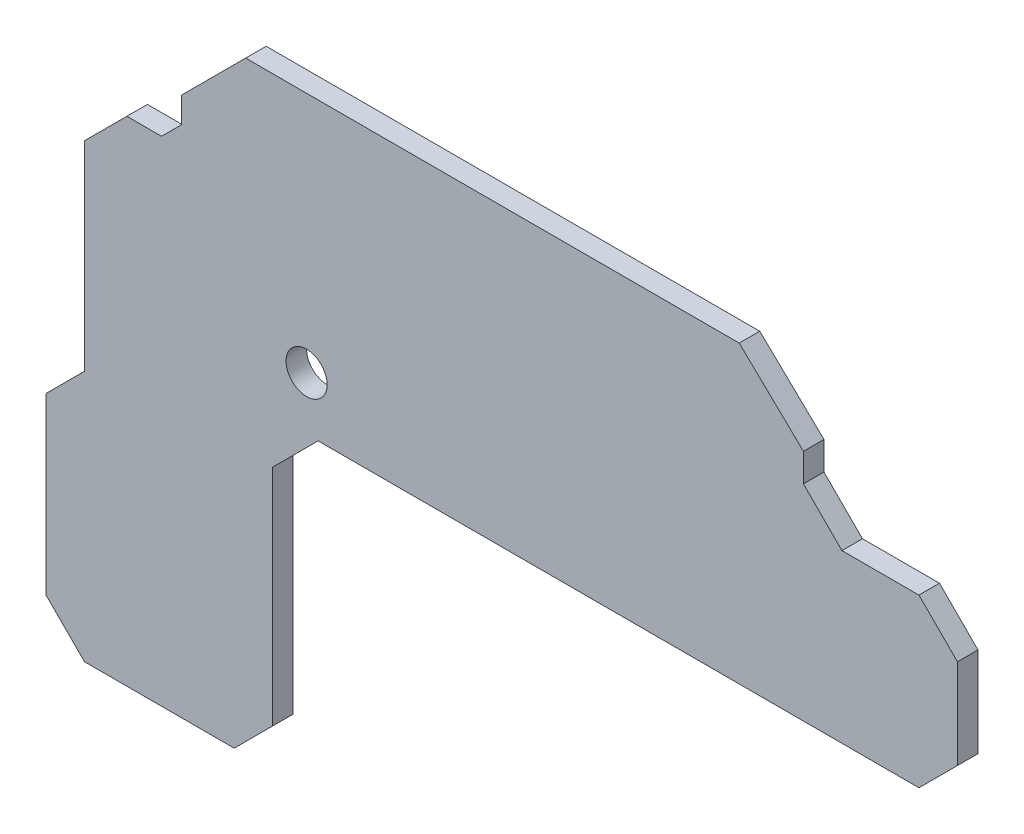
ISO-10303-21;
HEADER;
FILE_DESCRIPTION(('STEP AP214'),'2;1');
FILE_NAME('part.step','',(''),(''),'','','');
FILE_SCHEMA(('AUTOMOTIVE_DESIGN { 1 0 10303 214 1 1 1 1 }'));
ENDSEC;
DATA;
#1=APPLICATION_CONTEXT('core data for automotive mechanical design processes');
#2=APPLICATION_PROTOCOL_DEFINITION('international standard','automotive_design',2000,#1);
#3=PRODUCT_CONTEXT('',#1,'mechanical');
#4=PRODUCT('Part','Part','',(#3));
#5=PRODUCT_RELATED_PRODUCT_CATEGORY('part','',(#4));
#6=PRODUCT_DEFINITION_FORMATION('','',#4);
#7=PRODUCT_DEFINITION_CONTEXT('part definition',#1,'design');
#8=PRODUCT_DEFINITION('design','',#6,#7);
#9=PRODUCT_DEFINITION_SHAPE('','',#8);
#10=(LENGTH_UNIT() NAMED_UNIT(*) SI_UNIT(.MILLI.,.METRE.));
#11=(NAMED_UNIT(*) PLANE_ANGLE_UNIT() SI_UNIT($,.RADIAN.));
#12=(NAMED_UNIT(*) SI_UNIT($,.STERADIAN.) SOLID_ANGLE_UNIT());
#13=UNCERTAINTY_MEASURE_WITH_UNIT(LENGTH_MEASURE(1.E-05),#10,'distance_accuracy_value','');
#14=(GEOMETRIC_REPRESENTATION_CONTEXT(3) GLOBAL_UNCERTAINTY_ASSIGNED_CONTEXT((#13)) GLOBAL_UNIT_ASSIGNED_CONTEXT((#10,
#11,#12)) REPRESENTATION_CONTEXT('',''));
#15=CARTESIAN_POINT('',(0.,0.,0.));
#16=DIRECTION('',(0.,0.,1.));
#17=DIRECTION('',(1.,0.,0.));
#18=AXIS2_PLACEMENT_3D('',#15,#16,#17);
#19=CARTESIAN_POINT('',(0.,0.,0.));
#20=DIRECTION('',(0.,0.,1.));
#21=DIRECTION('',(1.,0.,0.));
#22=AXIS2_PLACEMENT_3D('',#19,#20,#21);
#23=PLANE('',#22);
#24=DIRECTION('',(0.707106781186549,0.707106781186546,0.));
#25=VECTOR('',#24,1.);
#26=CARTESIAN_POINT('',(-41.33,-15.9,0.));
#27=LINE('',#26,#25);
#28=CARTESIAN_POINT('',(-44.33,-18.9,0.));
#29=VERTEX_POINT('',#28);
#30=CARTESIAN_POINT('',(-41.33,-15.9,0.));
#31=VERTEX_POINT('',#30);
#32=EDGE_CURVE('E193',#29,#31,#27,.T.);
#33=ORIENTED_EDGE('',*,*,#32,.T.);
#34=DIRECTION('',(0.,1.,0.));
#35=VECTOR('',#34,1.);
#36=CARTESIAN_POINT('',(-41.33,-0.350000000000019,0.));
#37=LINE('',#36,#35);
#38=CARTESIAN_POINT('',(-41.33,-0.350000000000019,0.));
#39=VERTEX_POINT('',#38);
#40=EDGE_CURVE('E203',#31,#39,#37,.T.);
#41=ORIENTED_EDGE('',*,*,#40,.T.);
#42=DIRECTION('',(0.707106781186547,0.707106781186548,0.));
#43=VECTOR('',#42,1.);
#44=CARTESIAN_POINT('',(-38.03,2.94999999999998,0.));
#45=LINE('',#44,#43);
#46=CARTESIAN_POINT('',(-38.03,2.94999999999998,0.));
#47=VERTEX_POINT('',#46);
#48=EDGE_CURVE('E207',#39,#47,#45,.T.);
#49=ORIENTED_EDGE('',*,*,#48,.T.);
#50=DIRECTION('',(1.,0.,0.));
#51=VECTOR('',#50,1.);
#52=CARTESIAN_POINT('',(-35.33,2.94999999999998,0.));
#53=LINE('',#52,#51);
#54=CARTESIAN_POINT('',(-35.33,2.94999999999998,0.));
#55=VERTEX_POINT('',#54);
#56=EDGE_CURVE('E212',#47,#55,#53,.T.);
#57=ORIENTED_EDGE('',*,*,#56,.T.);
#58=DIRECTION('',(0.707106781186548,0.707106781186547,0.));
#59=VECTOR('',#58,1.);
#60=CARTESIAN_POINT('',(-33.78,4.49999999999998,0.));
#61=LINE('',#60,#59);
#62=CARTESIAN_POINT('',(-33.78,4.49999999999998,0.));
#63=VERTEX_POINT('',#62);
#64=EDGE_CURVE('E217',#55,#63,#61,.T.);
#65=ORIENTED_EDGE('',*,*,#64,.T.);
#66=DIRECTION('',(0.,1.,0.));
#67=VECTOR('',#66,1.);
#68=CARTESIAN_POINT('',(-33.78,6.49999999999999,0.));
#69=LINE('',#68,#67);
#70=CARTESIAN_POINT('',(-33.78,6.49999999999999,0.));
#71=VERTEX_POINT('',#70);
#72=EDGE_CURVE('E222',#63,#71,#69,.T.);
#73=ORIENTED_EDGE('',*,*,#72,.T.);
#74=DIRECTION('',(0.707106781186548,0.707106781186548,0.));
#75=VECTOR('',#74,1.);
#76=CARTESIAN_POINT('',(-28.78,11.5,0.));
#77=LINE('',#76,#75);
#78=CARTESIAN_POINT('',(-28.78,11.5,0.));
#79=VERTEX_POINT('',#78);
#80=EDGE_CURVE('E227',#71,#79,#77,.T.);
#81=ORIENTED_EDGE('',*,*,#80,.T.);
#82=DIRECTION('',(1.,0.,0.));
#83=VECTOR('',#82,1.);
#84=CARTESIAN_POINT('',(9.66999999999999,11.5,0.));
#85=LINE('',#84,#83);
#86=CARTESIAN_POINT('',(9.66999999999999,11.5,0.));
#87=VERTEX_POINT('',#86);
#88=EDGE_CURVE('E232',#79,#87,#85,.T.);
#89=ORIENTED_EDGE('',*,*,#88,.T.);
#90=DIRECTION('',(0.721387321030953,-0.692531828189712,0.));
#91=VECTOR('',#90,1.);
#92=CARTESIAN_POINT('',(14.67,6.70000000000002,0.));
#93=LINE('',#92,#91);
#94=CARTESIAN_POINT('',(14.67,6.70000000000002,0.));
#95=VERTEX_POINT('',#94);
#96=EDGE_CURVE('E237',#87,#95,#93,.T.);
#97=ORIENTED_EDGE('',*,*,#96,.T.);
#98=DIRECTION('',(0.,-1.,0.));
#99=VECTOR('',#98,1.);
#100=CARTESIAN_POINT('',(14.67,4.50000000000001,0.));
#101=LINE('',#100,#99);
#102=CARTESIAN_POINT('',(14.67,4.50000000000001,0.));
#103=VERTEX_POINT('',#102);
#104=EDGE_CURVE('E242',#95,#103,#101,.T.);
#105=ORIENTED_EDGE('',*,*,#104,.T.);
#106=DIRECTION('',(0.707106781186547,-0.707106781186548,0.));
#107=VECTOR('',#106,1.);
#108=CARTESIAN_POINT('',(17.67,1.50000000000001,0.));
#109=LINE('',#108,#107);
#110=CARTESIAN_POINT('',(17.67,1.50000000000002,0.));
#111=VERTEX_POINT('',#110);
#112=EDGE_CURVE('E247',#103,#111,#109,.T.);
#113=ORIENTED_EDGE('',*,*,#112,.T.);
#114=DIRECTION('',(1.,0.,0.));
#115=VECTOR('',#114,1.);
#116=CARTESIAN_POINT('',(23.67,1.50000000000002,0.));
#117=LINE('',#116,#115);
#118=CARTESIAN_POINT('',(23.67,1.50000000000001,0.));
#119=VERTEX_POINT('',#118);
#120=EDGE_CURVE('E252',#111,#119,#117,.T.);
#121=ORIENTED_EDGE('',*,*,#120,.T.);
#122=DIRECTION('',(0.707106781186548,-0.707106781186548,0.));
#123=VECTOR('',#122,1.);
#124=CARTESIAN_POINT('',(26.67,-1.49999999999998,0.));
#125=LINE('',#124,#123);
#126=CARTESIAN_POINT('',(26.67,-1.49999999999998,0.));
#127=VERTEX_POINT('',#126);
#128=EDGE_CURVE('E257',#119,#127,#125,.T.);
#129=ORIENTED_EDGE('',*,*,#128,.T.);
#130=DIRECTION('',(0.,1.,0.));
#131=VECTOR('',#130,1.);
#132=CARTESIAN_POINT('',(26.67,-8.49999999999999,0.));
#133=LINE('',#132,#131);
#134=CARTESIAN_POINT('',(26.67,-8.49999999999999,0.));
#135=VERTEX_POINT('',#134);
#136=EDGE_CURVE('E262',#127,#135,#133,.F.);
#137=ORIENTED_EDGE('',*,*,#136,.T.);
#138=DIRECTION('',(-0.707106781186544,-0.707106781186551,0.));
#139=VECTOR('',#138,1.);
#140=CARTESIAN_POINT('',(23.67,-11.5,0.));
#141=LINE('',#140,#139);
#142=CARTESIAN_POINT('',(23.67,-11.5,0.));
#143=VERTEX_POINT('',#142);
#144=EDGE_CURVE('E267',#135,#143,#141,.T.);
#145=ORIENTED_EDGE('',*,*,#144,.T.);
#146=DIRECTION('',(-1.,0.,0.));
#147=VECTOR('',#146,1.);
#148=CARTESIAN_POINT('',(-23.1339322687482,-11.5,0.));
#149=LINE('',#148,#147);
#150=CARTESIAN_POINT('',(-23.1339322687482,-11.5,0.));
#151=VERTEX_POINT('',#150);
#152=EDGE_CURVE('E272',#143,#151,#149,.T.);
#153=ORIENTED_EDGE('',*,*,#152,.T.);
#154=DIRECTION('',(-0.707213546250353,-0.707,0.));
#155=VECTOR('',#154,1.);
#156=CARTESIAN_POINT('',(-26.67,-15.035,0.));
#157=LINE('',#156,#155);
#158=CARTESIAN_POINT('',(-26.67,-15.035,0.));
#159=VERTEX_POINT('',#158);
#160=EDGE_CURVE('E277',#151,#159,#157,.T.);
#161=ORIENTED_EDGE('',*,*,#160,.T.);
#162=DIRECTION('',(0.,-1.,0.));
#163=VECTOR('',#162,1.);
#164=CARTESIAN_POINT('',(-26.67,-32.5,0.));
#165=LINE('',#164,#163);
#166=CARTESIAN_POINT('',(-26.67,-32.5,0.));
#167=VERTEX_POINT('',#166);
#168=EDGE_CURVE('E282',#159,#167,#165,.T.);
#169=ORIENTED_EDGE('',*,*,#168,.T.);
#170=DIRECTION('',(-0.707106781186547,-0.707106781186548,0.));
#171=VECTOR('',#170,1.);
#172=CARTESIAN_POINT('',(-29.67,-35.5,0.));
#173=LINE('',#172,#171);
#174=CARTESIAN_POINT('',(-29.67,-35.5,0.));
#175=VERTEX_POINT('',#174);
#176=EDGE_CURVE('E287',#167,#175,#173,.T.);
#177=ORIENTED_EDGE('',*,*,#176,.T.);
#178=DIRECTION('',(1.,0.,0.));
#179=VECTOR('',#178,1.);
#180=CARTESIAN_POINT('',(-41.33,-35.5,0.));
#181=LINE('',#180,#179);
#182=CARTESIAN_POINT('',(-41.33,-35.5,0.));
#183=VERTEX_POINT('',#182);
#184=EDGE_CURVE('E180',#175,#183,#181,.F.);
#185=ORIENTED_EDGE('',*,*,#184,.T.);
#186=DIRECTION('',(-0.707106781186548,0.707106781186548,0.));
#187=VECTOR('',#186,1.);
#188=CARTESIAN_POINT('',(-44.33,-32.5,0.));
#189=LINE('',#188,#187);
#190=CARTESIAN_POINT('',(-44.33,-32.5,0.));
#191=VERTEX_POINT('',#190);
#192=EDGE_CURVE('E163',#183,#191,#189,.T.);
#193=ORIENTED_EDGE('',*,*,#192,.T.);
#194=DIRECTION('',(0.,1.,0.));
#195=VECTOR('',#194,1.);
#196=CARTESIAN_POINT('',(-44.33,-18.9,0.));
#197=LINE('',#196,#195);
#198=EDGE_CURVE('E168',#191,#29,#197,.T.);
#199=ORIENTED_EDGE('',*,*,#198,.T.);
#200=EDGE_LOOP('',(#33,#41,#49,#57,#65,#73,#81,#89,#97,#105,#113,#121,#129,#137,#145,#153,#161,
#169,#177,#185,#193,#199));
#201=FACE_BOUND('',#200,.T.);
#202=CARTESIAN_POINT('',(-24.03,-7.36,0.));
#203=DIRECTION('',(0.,0.,1.));
#204=DIRECTION('',(1.,0.,0.));
#205=AXIS2_PLACEMENT_3D('',#202,#203,#204);
#206=CIRCLE('',#205,1.6);
#207=CARTESIAN_POINT('',(-22.43,-7.36,0.));
#208=VERTEX_POINT('',#207);
#209=EDGE_CURVE('E20',#208,#208,#206,.T.);
#210=ORIENTED_EDGE('',*,*,#209,.T.);
#211=EDGE_LOOP('',(#210));
#212=FACE_BOUND('',#211,.T.);
#213=ADVANCED_FACE('F17',(#201,#212),#23,.F.);
#214=CARTESIAN_POINT('',(-24.03,-7.36,0.));
#215=DIRECTION('',(0.,0.,1.));
#216=DIRECTION('',(1.,0.,0.));
#217=AXIS2_PLACEMENT_3D('',#214,#215,#216);
#218=CYLINDRICAL_SURFACE('',#217,1.6);
#219=CARTESIAN_POINT('',(-24.03,-7.36,1.6));
#220=DIRECTION('',(0.,0.,1.));
#221=DIRECTION('',(1.,0.,0.));
#222=AXIS2_PLACEMENT_3D('',#219,#220,#221);
#223=CIRCLE('',#222,1.6);
#224=CARTESIAN_POINT('',(-22.43,-7.36,1.6));
#225=VERTEX_POINT('',#224);
#226=EDGE_CURVE('E190',#225,#225,#223,.F.);
#227=ORIENTED_EDGE('',*,*,#226,.F.);
#228=EDGE_LOOP('',(#227));
#229=FACE_BOUND('',#228,.T.);
#230=ORIENTED_EDGE('',*,*,#209,.F.);
#231=EDGE_LOOP('',(#230));
#232=FACE_BOUND('',#231,.T.);
#233=ADVANCED_FACE('F612',(#229,#232),#218,.F.);
#234=CARTESIAN_POINT('',(-44.33,-18.9,1.6));
#235=DIRECTION('',(1.,0.,0.));
#236=DIRECTION('',(0.,0.,-1.));
#237=AXIS2_PLACEMENT_3D('',#234,#235,#236);
#238=PLANE('',#237);
#239=DIRECTION('',(0.,0.,1.));
#240=VECTOR('',#239,1.);
#241=CARTESIAN_POINT('',(-44.33,-32.5,1.6));
#242=LINE('',#241,#240);
#243=CARTESIAN_POINT('',(-44.33,-32.5,1.6));
#244=VERTEX_POINT('',#243);
#245=EDGE_CURVE('E170',#191,#244,#242,.T.);
#246=ORIENTED_EDGE('',*,*,#245,.T.);
#247=DIRECTION('',(0.,1.,0.));
#248=VECTOR('',#247,1.);
#249=CARTESIAN_POINT('',(-44.33,0.,1.6));
#250=LINE('',#249,#248);
#251=CARTESIAN_POINT('',(-44.33,-18.9,1.6));
#252=VERTEX_POINT('',#251);
#253=EDGE_CURVE('E192',#252,#244,#250,.F.);
#254=ORIENTED_EDGE('',*,*,#253,.F.);
#255=DIRECTION('',(0.,0.,1.));
#256=VECTOR('',#255,1.);
#257=CARTESIAN_POINT('',(-44.33,-18.9,1.6));
#258=LINE('',#257,#256);
#259=EDGE_CURVE('E173',#252,#29,#258,.F.);
#260=ORIENTED_EDGE('',*,*,#259,.T.);
#261=ORIENTED_EDGE('',*,*,#198,.F.);
#262=EDGE_LOOP('',(#246,#254,#260,#261));
#263=FACE_BOUND('',#262,.T.);
#264=ADVANCED_FACE('F169',(#263),#238,.F.);
#265=CARTESIAN_POINT('',(-44.33,-32.5,1.6));
#266=DIRECTION('',(0.707106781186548,0.707106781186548,0.));
#267=DIRECTION('',(-0.707106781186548,0.707106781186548,0.));
#268=AXIS2_PLACEMENT_3D('',#265,#266,#267);
#269=PLANE('',#268);
#270=DIRECTION('',(0.,0.,1.));
#271=VECTOR('',#270,1.);
#272=CARTESIAN_POINT('',(-41.33,-35.5,1.6));
#273=LINE('',#272,#271);
#274=CARTESIAN_POINT('',(-41.33,-35.5,1.6));
#275=VERTEX_POINT('',#274);
#276=EDGE_CURVE('E182',#183,#275,#273,.T.);
#277=ORIENTED_EDGE('',*,*,#276,.T.);
#278=DIRECTION('',(0.707106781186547,-0.707106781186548,0.));
#279=VECTOR('',#278,1.);
#280=CARTESIAN_POINT('',(-44.33,-32.5,1.6));
#281=LINE('',#280,#279);
#282=EDGE_CURVE('E186',#244,#275,#281,.T.);
#283=ORIENTED_EDGE('',*,*,#282,.F.);
#284=ORIENTED_EDGE('',*,*,#245,.F.);
#285=ORIENTED_EDGE('',*,*,#192,.F.);
#286=EDGE_LOOP('',(#277,#283,#284,#285));
#287=FACE_BOUND('',#286,.T.);
#288=ADVANCED_FACE('F184',(#287),#269,.F.);
#289=CARTESIAN_POINT('',(-41.33,-35.5,1.6));
#290=DIRECTION('',(0.,1.,0.));
#291=DIRECTION('',(0.,0.,1.));
#292=AXIS2_PLACEMENT_3D('',#289,#290,#291);
#293=PLANE('',#292);
#294=DIRECTION('',(0.,0.,1.));
#295=VECTOR('',#294,1.);
#296=CARTESIAN_POINT('',(-29.67,-35.5,1.6));
#297=LINE('',#296,#295);
#298=CARTESIAN_POINT('',(-29.67,-35.5,1.6));
#299=VERTEX_POINT('',#298);
#300=EDGE_CURVE('E289',#175,#299,#297,.T.);
#301=ORIENTED_EDGE('',*,*,#300,.T.);
#302=DIRECTION('',(1.,0.,0.));
#303=VECTOR('',#302,1.);
#304=CARTESIAN_POINT('',(0.,-35.5,1.6));
#305=LINE('',#304,#303);
#306=EDGE_CURVE('E294',#275,#299,#305,.T.);
#307=ORIENTED_EDGE('',*,*,#306,.F.);
#308=ORIENTED_EDGE('',*,*,#276,.F.);
#309=ORIENTED_EDGE('',*,*,#184,.F.);
#310=EDGE_LOOP('',(#301,#307,#308,#309));
#311=FACE_BOUND('',#310,.T.);
#312=ADVANCED_FACE('F295',(#311),#293,.F.);
#313=CARTESIAN_POINT('',(-29.67,-35.5,1.6));
#314=DIRECTION('',(-0.707106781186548,0.707106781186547,0.));
#315=DIRECTION('',(-0.707106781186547,-0.707106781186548,0.));
#316=AXIS2_PLACEMENT_3D('',#313,#314,#315);
#317=PLANE('',#316);
#318=DIRECTION('',(0.,0.,1.));
#319=VECTOR('',#318,1.);
#320=CARTESIAN_POINT('',(-26.67,-32.5,1.6));
#321=LINE('',#320,#319);
#322=CARTESIAN_POINT('',(-26.67,-32.5,1.6));
#323=VERTEX_POINT('',#322);
#324=EDGE_CURVE('E285',#167,#323,#321,.T.);
#325=ORIENTED_EDGE('',*,*,#324,.T.);
#326=DIRECTION('',(0.707106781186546,0.707106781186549,0.));
#327=VECTOR('',#326,1.);
#328=CARTESIAN_POINT('',(-29.67,-35.5,1.6));
#329=LINE('',#328,#327);
#330=EDGE_CURVE('E300',#299,#323,#329,.T.);
#331=ORIENTED_EDGE('',*,*,#330,.F.);
#332=ORIENTED_EDGE('',*,*,#300,.F.);
#333=ORIENTED_EDGE('',*,*,#176,.F.);
#334=EDGE_LOOP('',(#325,#331,#332,#333));
#335=FACE_BOUND('',#334,.T.);
#336=ADVANCED_FACE('F421',(#335),#317,.F.);
#337=CARTESIAN_POINT('',(-26.67,-32.5,1.6));
#338=DIRECTION('',(-1.,0.,0.));
#339=DIRECTION('',(0.,-1.,0.));
#340=AXIS2_PLACEMENT_3D('',#337,#338,#339);
#341=PLANE('',#340);
#342=DIRECTION('',(0.,0.,1.));
#343=VECTOR('',#342,1.);
#344=CARTESIAN_POINT('',(-26.67,-15.035,1.6));
#345=LINE('',#344,#343);
#346=CARTESIAN_POINT('',(-26.67,-15.035,1.6));
#347=VERTEX_POINT('',#346);
#348=EDGE_CURVE('E280',#159,#347,#345,.T.);
#349=ORIENTED_EDGE('',*,*,#348,.T.);
#350=DIRECTION('',(0.,1.,0.));
#351=VECTOR('',#350,1.);
#352=CARTESIAN_POINT('',(-26.67,0.,1.6));
#353=LINE('',#352,#351);
#354=EDGE_CURVE('E306',#323,#347,#353,.T.);
#355=ORIENTED_EDGE('',*,*,#354,.F.);
#356=ORIENTED_EDGE('',*,*,#324,.F.);
#357=ORIENTED_EDGE('',*,*,#168,.F.);
#358=EDGE_LOOP('',(#349,#355,#356,#357));
#359=FACE_BOUND('',#358,.T.);
#360=ADVANCED_FACE('F418',(#359),#341,.F.);
#361=CARTESIAN_POINT('',(-26.67,-15.035,1.6));
#362=DIRECTION('',(-0.707,0.707213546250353,0.));
#363=DIRECTION('',(-0.707213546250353,-0.707,0.));
#364=AXIS2_PLACEMENT_3D('',#361,#362,#363);
#365=PLANE('',#364);
#366=DIRECTION('',(0.,0.,1.));
#367=VECTOR('',#366,1.);
#368=CARTESIAN_POINT('',(-23.1339322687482,-11.5,1.6));
#369=LINE('',#368,#367);
#370=CARTESIAN_POINT('',(-23.1339322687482,-11.5,1.6));
#371=VERTEX_POINT('',#370);
#372=EDGE_CURVE('E275',#151,#371,#369,.T.);
#373=ORIENTED_EDGE('',*,*,#372,.T.);
#374=DIRECTION('',(0.707213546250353,0.707,0.));
#375=VECTOR('',#374,1.);
#376=CARTESIAN_POINT('',(-26.67,-15.035,1.6));
#377=LINE('',#376,#375);
#378=EDGE_CURVE('E309',#347,#371,#377,.T.);
#379=ORIENTED_EDGE('',*,*,#378,.F.);
#380=ORIENTED_EDGE('',*,*,#348,.F.);
#381=ORIENTED_EDGE('',*,*,#160,.F.);
#382=EDGE_LOOP('',(#373,#379,#380,#381));
#383=FACE_BOUND('',#382,.T.);
#384=ADVANCED_FACE('F415',(#383),#365,.F.);
#385=CARTESIAN_POINT('',(-23.1339322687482,-11.5,1.6));
#386=DIRECTION('',(0.,1.,0.));
#387=DIRECTION('',(-1.,0.,0.));
#388=AXIS2_PLACEMENT_3D('',#385,#386,#387);
#389=PLANE('',#388);
#390=DIRECTION('',(0.,0.,1.));
#391=VECTOR('',#390,1.);
#392=CARTESIAN_POINT('',(23.67,-11.5,1.6));
#393=LINE('',#392,#391);
#394=CARTESIAN_POINT('',(23.67,-11.5,1.6));
#395=VERTEX_POINT('',#394);
#396=EDGE_CURVE('E270',#143,#395,#393,.T.);
#397=ORIENTED_EDGE('',*,*,#396,.T.);
#398=DIRECTION('',(1.,0.,0.));
#399=VECTOR('',#398,1.);
#400=CARTESIAN_POINT('',(0.,-11.5,1.6));
#401=LINE('',#400,#399);
#402=EDGE_CURVE('E312',#371,#395,#401,.T.);
#403=ORIENTED_EDGE('',*,*,#402,.F.);
#404=ORIENTED_EDGE('',*,*,#372,.F.);
#405=ORIENTED_EDGE('',*,*,#152,.F.);
#406=EDGE_LOOP('',(#397,#403,#404,#405));
#407=FACE_BOUND('',#406,.T.);
#408=ADVANCED_FACE('F412',(#407),#389,.F.);
#409=CARTESIAN_POINT('',(23.67,-11.5,1.6));
#410=DIRECTION('',(-0.707106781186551,0.707106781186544,0.));
#411=DIRECTION('',(-0.707106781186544,-0.707106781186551,0.));
#412=AXIS2_PLACEMENT_3D('',#409,#410,#411);
#413=PLANE('',#412);
#414=DIRECTION('',(0.,0.,1.));
#415=VECTOR('',#414,1.);
#416=CARTESIAN_POINT('',(26.67,-8.49999999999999,1.6));
#417=LINE('',#416,#415);
#418=CARTESIAN_POINT('',(26.67,-8.49999999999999,1.6));
#419=VERTEX_POINT('',#418);
#420=EDGE_CURVE('E265',#135,#419,#417,.T.);
#421=ORIENTED_EDGE('',*,*,#420,.T.);
#422=DIRECTION('',(0.707106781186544,0.707106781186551,0.));
#423=VECTOR('',#422,1.);
#424=CARTESIAN_POINT('',(23.67,-11.5,1.6));
#425=LINE('',#424,#423);
#426=EDGE_CURVE('E315',#395,#419,#425,.T.);
#427=ORIENTED_EDGE('',*,*,#426,.F.);
#428=ORIENTED_EDGE('',*,*,#396,.F.);
#429=ORIENTED_EDGE('',*,*,#144,.F.);
#430=EDGE_LOOP('',(#421,#427,#428,#429));
#431=FACE_BOUND('',#430,.T.);
#432=ADVANCED_FACE('F406',(#431),#413,.F.);
#433=CARTESIAN_POINT('',(26.67,-8.49999999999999,1.6));
#434=DIRECTION('',(-1.,0.,0.));
#435=DIRECTION('',(0.,0.,1.));
#436=AXIS2_PLACEMENT_3D('',#433,#434,#435);
#437=PLANE('',#436);
#438=DIRECTION('',(0.,0.,1.));
#439=VECTOR('',#438,1.);
#440=CARTESIAN_POINT('',(26.67,-1.49999999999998,1.6));
#441=LINE('',#440,#439);
#442=CARTESIAN_POINT('',(26.67,-1.49999999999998,1.6));
#443=VERTEX_POINT('',#442);
#444=EDGE_CURVE('E260',#127,#443,#441,.T.);
#445=ORIENTED_EDGE('',*,*,#444,.T.);
#446=DIRECTION('',(0.,1.,0.));
#447=VECTOR('',#446,1.);
#448=CARTESIAN_POINT('',(26.67,0.,1.6));
#449=LINE('',#448,#447);
#450=EDGE_CURVE('E318',#419,#443,#449,.T.);
#451=ORIENTED_EDGE('',*,*,#450,.F.);
#452=ORIENTED_EDGE('',*,*,#420,.F.);
#453=ORIENTED_EDGE('',*,*,#136,.F.);
#454=EDGE_LOOP('',(#445,#451,#452,#453));
#455=FACE_BOUND('',#454,.T.);
#456=ADVANCED_FACE('F403',(#455),#437,.F.);
#457=CARTESIAN_POINT('',(26.67,-1.49999999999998,1.6));
#458=DIRECTION('',(-0.707106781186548,-0.707106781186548,0.));
#459=DIRECTION('',(0.707106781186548,-0.707106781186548,0.));
#460=AXIS2_PLACEMENT_3D('',#457,#458,#459);
#461=PLANE('',#460);
#462=DIRECTION('',(0.,0.,1.));
#463=VECTOR('',#462,1.);
#464=CARTESIAN_POINT('',(23.67,1.50000000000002,1.6));
#465=LINE('',#464,#463);
#466=CARTESIAN_POINT('',(23.67,1.50000000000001,1.6));
#467=VERTEX_POINT('',#466);
#468=EDGE_CURVE('E255',#119,#467,#465,.T.);
#469=ORIENTED_EDGE('',*,*,#468,.T.);
#470=DIRECTION('',(-0.707106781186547,0.707106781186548,0.));
#471=VECTOR('',#470,1.);
#472=CARTESIAN_POINT('',(26.67,-1.49999999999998,1.6));
#473=LINE('',#472,#471);
#474=EDGE_CURVE('E321',#443,#467,#473,.T.);
#475=ORIENTED_EDGE('',*,*,#474,.F.);
#476=ORIENTED_EDGE('',*,*,#444,.F.);
#477=ORIENTED_EDGE('',*,*,#128,.F.);
#478=EDGE_LOOP('',(#469,#475,#476,#477));
#479=FACE_BOUND('',#478,.T.);
#480=ADVANCED_FACE('F400',(#479),#461,.F.);
#481=CARTESIAN_POINT('',(23.67,1.50000000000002,1.6));
#482=DIRECTION('',(0.,-1.,0.));
#483=DIRECTION('',(1.,0.,0.));
#484=AXIS2_PLACEMENT_3D('',#481,#482,#483);
#485=PLANE('',#484);
#486=DIRECTION('',(0.,0.,1.));
#487=VECTOR('',#486,1.);
#488=CARTESIAN_POINT('',(17.67,1.50000000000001,1.6));
#489=LINE('',#488,#487);
#490=CARTESIAN_POINT('',(17.67,1.50000000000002,1.6));
#491=VERTEX_POINT('',#490);
#492=EDGE_CURVE('E250',#111,#491,#489,.T.);
#493=ORIENTED_EDGE('',*,*,#492,.T.);
#494=DIRECTION('',(1.,0.,0.));
#495=VECTOR('',#494,1.);
#496=CARTESIAN_POINT('',(0.,1.50000000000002,1.6));
#497=LINE('',#496,#495);
#498=EDGE_CURVE('E324',#467,#491,#497,.F.);
#499=ORIENTED_EDGE('',*,*,#498,.F.);
#500=ORIENTED_EDGE('',*,*,#468,.F.);
#501=ORIENTED_EDGE('',*,*,#120,.F.);
#502=EDGE_LOOP('',(#493,#499,#500,#501));
#503=FACE_BOUND('',#502,.T.);
#504=ADVANCED_FACE('F394',(#503),#485,.F.);
#505=CARTESIAN_POINT('',(17.67,1.50000000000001,1.6));
#506=DIRECTION('',(-0.707106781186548,-0.707106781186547,0.));
#507=DIRECTION('',(0.707106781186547,-0.707106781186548,0.));
#508=AXIS2_PLACEMENT_3D('',#505,#506,#507);
#509=PLANE('',#508);
#510=DIRECTION('',(0.,0.,1.));
#511=VECTOR('',#510,1.);
#512=CARTESIAN_POINT('',(14.67,4.50000000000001,1.6));
#513=LINE('',#512,#511);
#514=CARTESIAN_POINT('',(14.67,4.50000000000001,1.6));
#515=VERTEX_POINT('',#514);
#516=EDGE_CURVE('E245',#103,#515,#513,.T.);
#517=ORIENTED_EDGE('',*,*,#516,.T.);
#518=DIRECTION('',(-0.707106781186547,0.707106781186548,0.));
#519=VECTOR('',#518,1.);
#520=CARTESIAN_POINT('',(17.67,1.50000000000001,1.6));
#521=LINE('',#520,#519);
#522=EDGE_CURVE('E327',#491,#515,#521,.T.);
#523=ORIENTED_EDGE('',*,*,#522,.F.);
#524=ORIENTED_EDGE('',*,*,#492,.F.);
#525=ORIENTED_EDGE('',*,*,#112,.F.);
#526=EDGE_LOOP('',(#517,#523,#524,#525));
#527=FACE_BOUND('',#526,.T.);
#528=ADVANCED_FACE('F391',(#527),#509,.F.);
#529=CARTESIAN_POINT('',(14.67,4.50000000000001,1.6));
#530=DIRECTION('',(-1.,0.,0.));
#531=DIRECTION('',(0.,-1.,0.));
#532=AXIS2_PLACEMENT_3D('',#529,#530,#531);
#533=PLANE('',#532);
#534=DIRECTION('',(0.,0.,1.));
#535=VECTOR('',#534,1.);
#536=CARTESIAN_POINT('',(14.67,6.70000000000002,1.6));
#537=LINE('',#536,#535);
#538=CARTESIAN_POINT('',(14.67,6.70000000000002,1.6));
#539=VERTEX_POINT('',#538);
#540=EDGE_CURVE('E240',#95,#539,#537,.T.);
#541=ORIENTED_EDGE('',*,*,#540,.T.);
#542=DIRECTION('',(0.,1.,0.));
#543=VECTOR('',#542,1.);
#544=CARTESIAN_POINT('',(14.67,0.,1.6));
#545=LINE('',#544,#543);
#546=EDGE_CURVE('E330',#515,#539,#545,.T.);
#547=ORIENTED_EDGE('',*,*,#546,.F.);
#548=ORIENTED_EDGE('',*,*,#516,.F.);
#549=ORIENTED_EDGE('',*,*,#104,.F.);
#550=EDGE_LOOP('',(#541,#547,#548,#549));
#551=FACE_BOUND('',#550,.T.);
#552=ADVANCED_FACE('F388',(#551),#533,.F.);
#553=CARTESIAN_POINT('',(14.67,6.70000000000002,1.6));
#554=DIRECTION('',(-0.692531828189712,-0.721387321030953,0.));
#555=DIRECTION('',(0.721387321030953,-0.692531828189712,0.));
#556=AXIS2_PLACEMENT_3D('',#553,#554,#555);
#557=PLANE('',#556);
#558=DIRECTION('',(0.,0.,1.));
#559=VECTOR('',#558,1.);
#560=CARTESIAN_POINT('',(9.66999999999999,11.5,1.6));
#561=LINE('',#560,#559);
#562=CARTESIAN_POINT('',(9.66999999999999,11.5,1.6));
#563=VERTEX_POINT('',#562);
#564=EDGE_CURVE('E235',#87,#563,#561,.T.);
#565=ORIENTED_EDGE('',*,*,#564,.T.);
#566=DIRECTION('',(-0.721387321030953,0.692531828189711,0.));
#567=VECTOR('',#566,1.);
#568=CARTESIAN_POINT('',(14.67,6.70000000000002,1.6));
#569=LINE('',#568,#567);
#570=EDGE_CURVE('E333',#539,#563,#569,.T.);
#571=ORIENTED_EDGE('',*,*,#570,.F.);
#572=ORIENTED_EDGE('',*,*,#540,.F.);
#573=ORIENTED_EDGE('',*,*,#96,.F.);
#574=EDGE_LOOP('',(#565,#571,#572,#573));
#575=FACE_BOUND('',#574,.T.);
#576=ADVANCED_FACE('F382',(#575),#557,.F.);
#577=CARTESIAN_POINT('',(9.66999999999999,11.5,1.6));
#578=DIRECTION('',(0.,-1.,0.));
#579=DIRECTION('',(1.,0.,0.));
#580=AXIS2_PLACEMENT_3D('',#577,#578,#579);
#581=PLANE('',#580);
#582=DIRECTION('',(0.,0.,1.));
#583=VECTOR('',#582,1.);
#584=CARTESIAN_POINT('',(-28.78,11.5,1.6));
#585=LINE('',#584,#583);
#586=CARTESIAN_POINT('',(-28.78,11.5,1.6));
#587=VERTEX_POINT('',#586);
#588=EDGE_CURVE('E230',#79,#587,#585,.T.);
#589=ORIENTED_EDGE('',*,*,#588,.T.);
#590=DIRECTION('',(1.,0.,0.));
#591=VECTOR('',#590,1.);
#592=CARTESIAN_POINT('',(0.,11.5,1.6));
#593=LINE('',#592,#591);
#594=EDGE_CURVE('E336',#563,#587,#593,.F.);
#595=ORIENTED_EDGE('',*,*,#594,.F.);
#596=ORIENTED_EDGE('',*,*,#564,.F.);
#597=ORIENTED_EDGE('',*,*,#88,.F.);
#598=EDGE_LOOP('',(#589,#595,#596,#597));
#599=FACE_BOUND('',#598,.T.);
#600=ADVANCED_FACE('F379',(#599),#581,.F.);
#601=CARTESIAN_POINT('',(-28.78,11.5,1.6));
#602=DIRECTION('',(0.707106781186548,-0.707106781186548,0.));
#603=DIRECTION('',(0.707106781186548,0.707106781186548,0.));
#604=AXIS2_PLACEMENT_3D('',#601,#602,#603);
#605=PLANE('',#604);
#606=DIRECTION('',(0.,0.,-1.));
#607=VECTOR('',#606,1.);
#608=CARTESIAN_POINT('',(-33.78,6.49999999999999,1.6));
#609=LINE('',#608,#607);
#610=CARTESIAN_POINT('',(-33.78,6.49999999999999,1.6));
#611=VERTEX_POINT('',#610);
#612=EDGE_CURVE('E225',#71,#611,#609,.F.);
#613=ORIENTED_EDGE('',*,*,#612,.T.);
#614=DIRECTION('',(-0.707106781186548,-0.707106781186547,0.));
#615=VECTOR('',#614,1.);
#616=CARTESIAN_POINT('',(-28.78,11.5,1.6));
#617=LINE('',#616,#615);
#618=EDGE_CURVE('E339',#587,#611,#617,.T.);
#619=ORIENTED_EDGE('',*,*,#618,.F.);
#620=ORIENTED_EDGE('',*,*,#588,.F.);
#621=ORIENTED_EDGE('',*,*,#80,.F.);
#622=EDGE_LOOP('',(#613,#619,#620,#621));
#623=FACE_BOUND('',#622,.T.);
#624=ADVANCED_FACE('F376',(#623),#605,.F.);
#625=CARTESIAN_POINT('',(-33.78,6.49999999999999,1.6));
#626=DIRECTION('',(1.,0.,0.));
#627=DIRECTION('',(0.,0.,-1.));
#628=AXIS2_PLACEMENT_3D('',#625,#626,#627);
#629=PLANE('',#628);
#630=DIRECTION('',(0.,0.,1.));
#631=VECTOR('',#630,1.);
#632=CARTESIAN_POINT('',(-33.78,4.49999999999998,1.6));
#633=LINE('',#632,#631);
#634=CARTESIAN_POINT('',(-33.78,4.49999999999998,1.6));
#635=VERTEX_POINT('',#634);
#636=EDGE_CURVE('E220',#63,#635,#633,.T.);
#637=ORIENTED_EDGE('',*,*,#636,.T.);
#638=DIRECTION('',(0.,1.,0.));
#639=VECTOR('',#638,1.);
#640=CARTESIAN_POINT('',(-33.78,0.,1.6));
#641=LINE('',#640,#639);
#642=EDGE_CURVE('E342',#611,#635,#641,.F.);
#643=ORIENTED_EDGE('',*,*,#642,.F.);
#644=ORIENTED_EDGE('',*,*,#612,.F.);
#645=ORIENTED_EDGE('',*,*,#72,.F.);
#646=EDGE_LOOP('',(#637,#643,#644,#645));
#647=FACE_BOUND('',#646,.T.);
#648=ADVANCED_FACE('F370',(#647),#629,.F.);
#649=CARTESIAN_POINT('',(-33.78,4.49999999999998,1.6));
#650=DIRECTION('',(0.707106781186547,-0.707106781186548,0.));
#651=DIRECTION('',(0.707106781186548,0.707106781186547,0.));
#652=AXIS2_PLACEMENT_3D('',#649,#650,#651);
#653=PLANE('',#652);
#654=DIRECTION('',(0.,0.,-1.));
#655=VECTOR('',#654,1.);
#656=CARTESIAN_POINT('',(-35.33,2.94999999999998,1.6));
#657=LINE('',#656,#655);
#658=CARTESIAN_POINT('',(-35.33,2.94999999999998,1.6));
#659=VERTEX_POINT('',#658);
#660=EDGE_CURVE('E215',#55,#659,#657,.F.);
#661=ORIENTED_EDGE('',*,*,#660,.T.);
#662=DIRECTION('',(-0.707106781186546,-0.707106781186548,0.));
#663=VECTOR('',#662,1.);
#664=CARTESIAN_POINT('',(-33.78,4.49999999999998,1.6));
#665=LINE('',#664,#663);
#666=EDGE_CURVE('E345',#635,#659,#665,.T.);
#667=ORIENTED_EDGE('',*,*,#666,.F.);
#668=ORIENTED_EDGE('',*,*,#636,.F.);
#669=ORIENTED_EDGE('',*,*,#64,.F.);
#670=EDGE_LOOP('',(#661,#667,#668,#669));
#671=FACE_BOUND('',#670,.T.);
#672=ADVANCED_FACE('F367',(#671),#653,.F.);
#673=CARTESIAN_POINT('',(-35.33,2.94999999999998,1.6));
#674=DIRECTION('',(0.,-1.,0.));
#675=DIRECTION('',(0.,0.,-1.));
#676=AXIS2_PLACEMENT_3D('',#673,#674,#675);
#677=PLANE('',#676);
#678=DIRECTION('',(0.,0.,1.));
#679=VECTOR('',#678,1.);
#680=CARTESIAN_POINT('',(-38.03,2.94999999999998,1.6));
#681=LINE('',#680,#679);
#682=CARTESIAN_POINT('',(-38.03,2.94999999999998,1.6));
#683=VERTEX_POINT('',#682);
#684=EDGE_CURVE('E210',#47,#683,#681,.T.);
#685=ORIENTED_EDGE('',*,*,#684,.T.);
#686=DIRECTION('',(1.,0.,0.));
#687=VECTOR('',#686,1.);
#688=CARTESIAN_POINT('',(0.,2.94999999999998,1.6));
#689=LINE('',#688,#687);
#690=EDGE_CURVE('E348',#659,#683,#689,.F.);
#691=ORIENTED_EDGE('',*,*,#690,.F.);
#692=ORIENTED_EDGE('',*,*,#660,.F.);
#693=ORIENTED_EDGE('',*,*,#56,.F.);
#694=EDGE_LOOP('',(#685,#691,#692,#693));
#695=FACE_BOUND('',#694,.T.);
#696=ADVANCED_FACE('F364',(#695),#677,.F.);
#697=CARTESIAN_POINT('',(-38.03,2.94999999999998,1.6));
#698=DIRECTION('',(0.707106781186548,-0.707106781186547,0.));
#699=DIRECTION('',(0.707106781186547,0.707106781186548,0.));
#700=AXIS2_PLACEMENT_3D('',#697,#698,#699);
#701=PLANE('',#700);
#702=DIRECTION('',(0.,0.,1.));
#703=VECTOR('',#702,1.);
#704=CARTESIAN_POINT('',(-41.33,-0.350000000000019,1.6));
#705=LINE('',#704,#703);
#706=CARTESIAN_POINT('',(-41.33,-0.350000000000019,1.6));
#707=VERTEX_POINT('',#706);
#708=EDGE_CURVE('E205',#39,#707,#705,.T.);
#709=ORIENTED_EDGE('',*,*,#708,.T.);
#710=DIRECTION('',(-0.707106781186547,-0.707106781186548,0.));
#711=VECTOR('',#710,1.);
#712=CARTESIAN_POINT('',(-38.03,2.94999999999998,1.6));
#713=LINE('',#712,#711);
#714=EDGE_CURVE('E351',#683,#707,#713,.T.);
#715=ORIENTED_EDGE('',*,*,#714,.F.);
#716=ORIENTED_EDGE('',*,*,#684,.F.);
#717=ORIENTED_EDGE('',*,*,#48,.F.);
#718=EDGE_LOOP('',(#709,#715,#716,#717));
#719=FACE_BOUND('',#718,.T.);
#720=ADVANCED_FACE('F358',(#719),#701,.F.);
#721=CARTESIAN_POINT('',(-41.33,-0.350000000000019,1.6));
#722=DIRECTION('',(1.,0.,0.));
#723=DIRECTION('',(0.,1.,0.));
#724=AXIS2_PLACEMENT_3D('',#721,#722,#723);
#725=PLANE('',#724);
#726=DIRECTION('',(0.,0.,1.));
#727=VECTOR('',#726,1.);
#728=CARTESIAN_POINT('',(-41.33,-15.9,1.6));
#729=LINE('',#728,#727);
#730=CARTESIAN_POINT('',(-41.33,-15.9,1.6));
#731=VERTEX_POINT('',#730);
#732=EDGE_CURVE('E35',#31,#731,#729,.T.);
#733=ORIENTED_EDGE('',*,*,#732,.T.);
#734=DIRECTION('',(0.,1.,0.));
#735=VECTOR('',#734,1.);
#736=CARTESIAN_POINT('',(-41.33,0.,1.6));
#737=LINE('',#736,#735);
#738=EDGE_CURVE('E26',#707,#731,#737,.F.);
#739=ORIENTED_EDGE('',*,*,#738,.F.);
#740=ORIENTED_EDGE('',*,*,#708,.F.);
#741=ORIENTED_EDGE('',*,*,#40,.F.);
#742=EDGE_LOOP('',(#733,#739,#740,#741));
#743=FACE_BOUND('',#742,.T.);
#744=ADVANCED_FACE('F356',(#743),#725,.F.);
#745=CARTESIAN_POINT('',(-41.33,-15.9,1.6));
#746=DIRECTION('',(0.707106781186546,-0.707106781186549,0.));
#747=DIRECTION('',(0.707106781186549,0.707106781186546,0.));
#748=AXIS2_PLACEMENT_3D('',#745,#746,#747);
#749=PLANE('',#748);
#750=ORIENTED_EDGE('',*,*,#259,.F.);
#751=DIRECTION('',(-0.707106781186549,-0.707106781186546,0.));
#752=VECTOR('',#751,1.);
#753=CARTESIAN_POINT('',(-41.33,-15.9,1.6));
#754=LINE('',#753,#752);
#755=EDGE_CURVE('E11',#731,#252,#754,.T.);
#756=ORIENTED_EDGE('',*,*,#755,.F.);
#757=ORIENTED_EDGE('',*,*,#732,.F.);
#758=ORIENTED_EDGE('',*,*,#32,.F.);
#759=EDGE_LOOP('',(#750,#756,#757,#758));
#760=FACE_BOUND('',#759,.T.);
#761=ADVANCED_FACE('F432',(#760),#749,.F.);
#762=CARTESIAN_POINT('',(0.,0.,1.6));
#763=DIRECTION('',(0.,0.,1.));
#764=DIRECTION('',(1.,0.,0.));
#765=AXIS2_PLACEMENT_3D('',#762,#763,#764);
#766=PLANE('',#765);
#767=ORIENTED_EDGE('',*,*,#738,.T.);
#768=ORIENTED_EDGE('',*,*,#755,.T.);
#769=ORIENTED_EDGE('',*,*,#253,.T.);
#770=ORIENTED_EDGE('',*,*,#282,.T.);
#771=ORIENTED_EDGE('',*,*,#306,.T.);
#772=ORIENTED_EDGE('',*,*,#330,.T.);
#773=ORIENTED_EDGE('',*,*,#354,.T.);
#774=ORIENTED_EDGE('',*,*,#378,.T.);
#775=ORIENTED_EDGE('',*,*,#402,.T.);
#776=ORIENTED_EDGE('',*,*,#426,.T.);
#777=ORIENTED_EDGE('',*,*,#450,.T.);
#778=ORIENTED_EDGE('',*,*,#474,.T.);
#779=ORIENTED_EDGE('',*,*,#498,.T.);
#780=ORIENTED_EDGE('',*,*,#522,.T.);
#781=ORIENTED_EDGE('',*,*,#546,.T.);
#782=ORIENTED_EDGE('',*,*,#570,.T.);
#783=ORIENTED_EDGE('',*,*,#594,.T.);
#784=ORIENTED_EDGE('',*,*,#618,.T.);
#785=ORIENTED_EDGE('',*,*,#642,.T.);
#786=ORIENTED_EDGE('',*,*,#666,.T.);
#787=ORIENTED_EDGE('',*,*,#690,.T.);
#788=ORIENTED_EDGE('',*,*,#714,.T.);
#789=EDGE_LOOP('',(#767,#768,#769,#770,#771,#772,#773,#774,#775,#776,#777,#778,#779,#780,#781,
#782,#783,#784,#785,#786,#787,#788));
#790=FACE_BOUND('',#789,.T.);
#791=ORIENTED_EDGE('',*,*,#226,.T.);
#792=EDGE_LOOP('',(#791));
#793=FACE_BOUND('',#792,.T.);
#794=ADVANCED_FACE('F303',(#790,#793),#766,.T.);
#795=CLOSED_SHELL('',(#213,#233,#264,#288,#312,#336,#360,#384,#408,#432,#456,#480,#504,#528,
#552,#576,#600,#624,#648,#672,#696,#720,#744,#761,#794));
#796=MANIFOLD_SOLID_BREP('B1',#795);
#797=ADVANCED_BREP_SHAPE_REPRESENTATION('',(#18,#796),#14);
#798=SHAPE_DEFINITION_REPRESENTATION(#9,#797);
ENDSEC;
END-ISO-10303-21;
